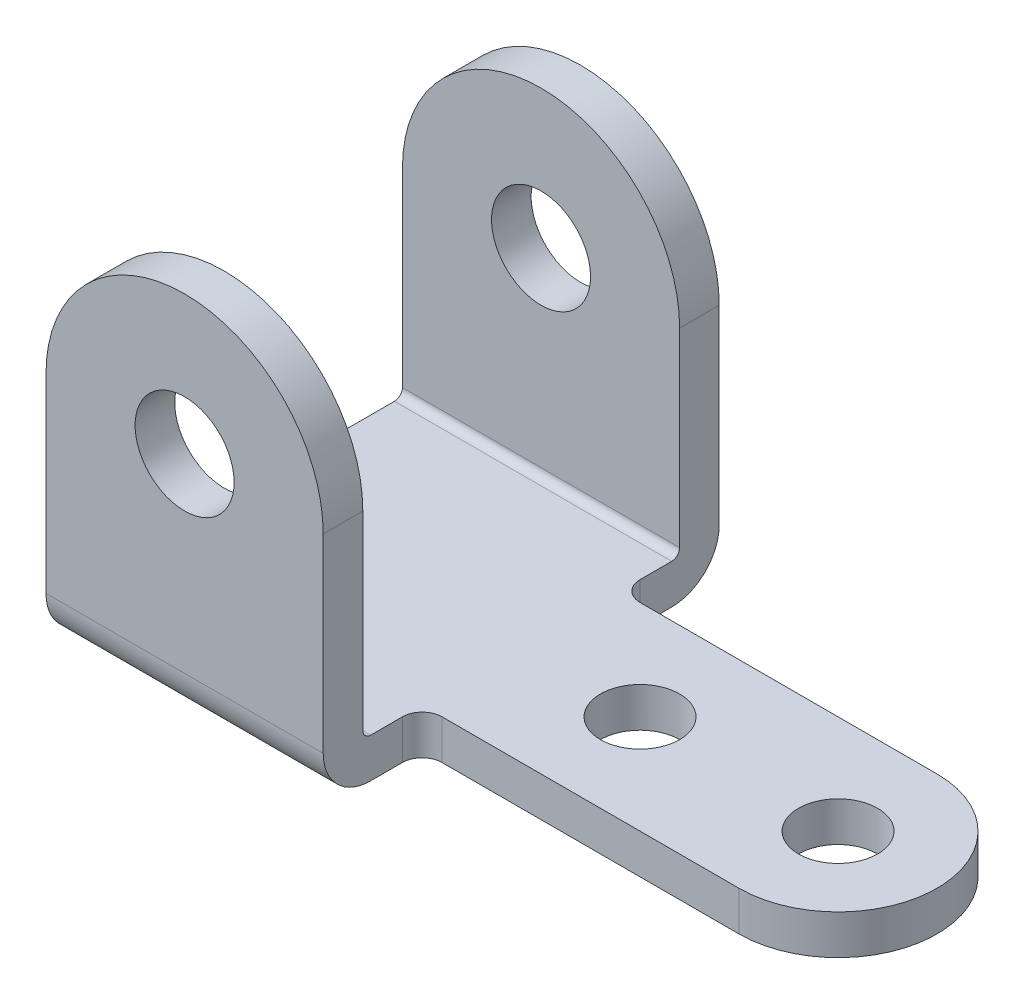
from build123d import *

# Parameters (mm, degrees)
U_SHAPE_DEPTH        = 100
FILLET_2_R           = 12
THICKNESS_T          = -10
SKETCH8_R            = 12.5
INNER_HOLE_DEPTH     = 122.757956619
TONGUE_DEPTH         = 10
SKETCH9_R            = 10
MOUNTING_HOLES_DEPTH = 197.53244007
FILLET1_R            = 5


with BuildPart() as part:
    # Sketch4 → U_ shape (new body)
    with BuildSketch(Plane.XY):
        with BuildLine():
            Line((-35, 0), (-35, -60))
            Line((-35, -60), (35, -60))
            Line((35, -60), (35, 0))
            ThreePointArc((35, 0), (0, 35), (-35, 0))
        make_face()
    extrude(amount=U_SHAPE_DEPTH)

    # Fillet 2
    fillet_2_edges = [part.edges().sort_by_distance(p)[0] for p in [
        (0, -60, 100),
        (0, -60, 0),
    ]]
    fillet(fillet_2_edges, radius=FILLET_2_R)

    # Thickness
    thickness_openings = [part.faces().sort_by_distance(p)[0] for p in [
        (35, -29.715655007, 50),
        (-35, -29.715655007, 50),
        (0, 35, 50),
    ]]
    offset(amount=THICKNESS_T, openings=thickness_openings, kind=Kind.INTERSECTION)

    # Sketch8 → Inner Hole (cut, through all)
    with BuildSketch(Plane.XY.offset(100)):
        Circle(SKETCH8_R)
    extrude(amount=-INNER_HOLE_DEPTH, mode=Mode.SUBTRACT)

    # Sketch7 → Tongue (add)
    with BuildSketch(Plane.XZ.offset(60)):
        with BuildLine():
            Line((35, 25), (115, 25))
            ThreePointArc((115, 25), (140, 50), (115, 75))
            Line((115, 75), (35, 75))
            Line((35, 75), (35, 25))
        make_face()
    extrude(amount=-TONGUE_DEPTH)

    # Sketch9 → Mounting Holes (cut, through all)
    with BuildSketch(Plane.XZ.offset(60)):
        with Locations((65, 50)):
            Circle(SKETCH9_R)
        with Locations((115, 50)):
            Circle(SKETCH9_R)
    extrude(amount=-MOUNTING_HOLES_DEPTH, mode=Mode.SUBTRACT)

    # Fillet1
    fillet1_edges = [part.edges().sort_by_distance(p)[0] for p in [
        (35, -55, 75),
        (35, -55, 25),
    ]]
    fillet(fillet1_edges, radius=FILLET1_R)


solid = part.part
